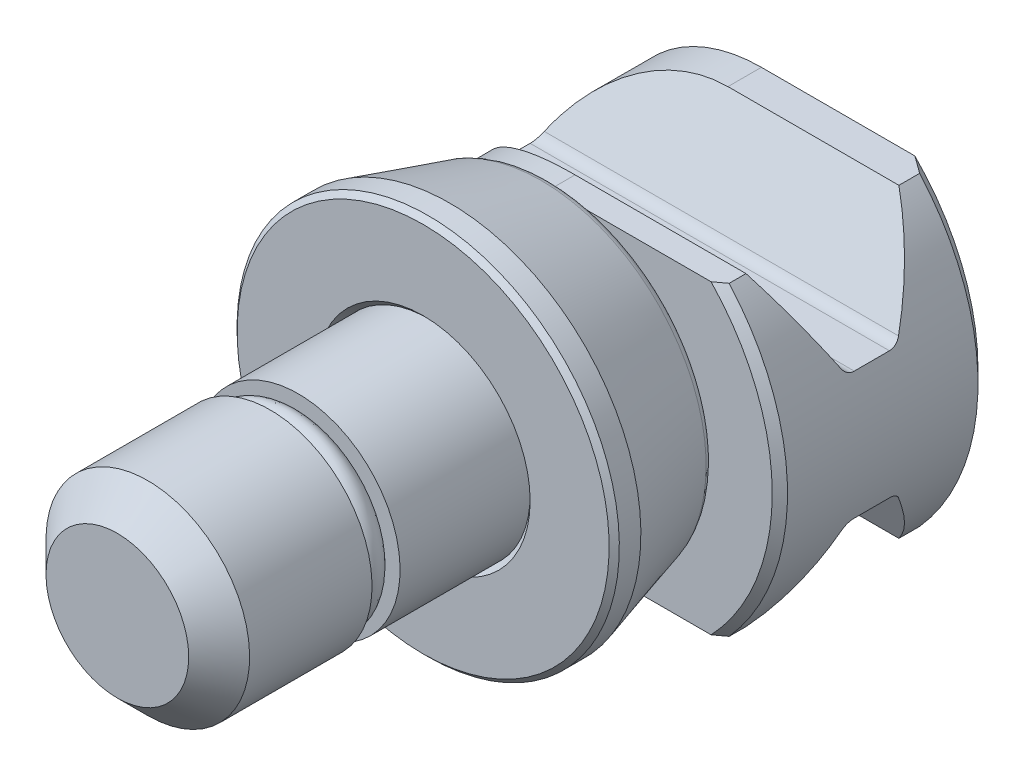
ISO-10303-21;
HEADER;
FILE_DESCRIPTION(('STEP AP214'),'2;1');
FILE_NAME('part.step','',(''),(''),'','','');
FILE_SCHEMA(('AUTOMOTIVE_DESIGN { 1 0 10303 214 1 1 1 1 }'));
ENDSEC;
DATA;
#1=APPLICATION_CONTEXT('core data for automotive mechanical design processes');
#2=APPLICATION_PROTOCOL_DEFINITION('international standard','automotive_design',2000,#1);
#3=PRODUCT_CONTEXT('',#1,'mechanical');
#4=PRODUCT('Part','Part','',(#3));
#5=PRODUCT_RELATED_PRODUCT_CATEGORY('part','',(#4));
#6=PRODUCT_DEFINITION_FORMATION('','',#4);
#7=PRODUCT_DEFINITION_CONTEXT('part definition',#1,'design');
#8=PRODUCT_DEFINITION('design','',#6,#7);
#9=PRODUCT_DEFINITION_SHAPE('','',#8);
#10=(LENGTH_UNIT() NAMED_UNIT(*) SI_UNIT(.MILLI.,.METRE.));
#11=(NAMED_UNIT(*) PLANE_ANGLE_UNIT() SI_UNIT($,.RADIAN.));
#12=(NAMED_UNIT(*) SI_UNIT($,.STERADIAN.) SOLID_ANGLE_UNIT());
#13=UNCERTAINTY_MEASURE_WITH_UNIT(LENGTH_MEASURE(1.E-05),#10,'distance_accuracy_value','');
#14=(GEOMETRIC_REPRESENTATION_CONTEXT(3) GLOBAL_UNCERTAINTY_ASSIGNED_CONTEXT((#13)) GLOBAL_UNIT_ASSIGNED_CONTEXT((#10,
#11,#12)) REPRESENTATION_CONTEXT('',''));
#15=CARTESIAN_POINT('',(0.,0.,0.));
#16=DIRECTION('',(0.,0.,1.));
#17=DIRECTION('',(1.,0.,0.));
#18=AXIS2_PLACEMENT_3D('',#15,#16,#17);
#19=CARTESIAN_POINT('',(0.,0.,-4.5));
#20=DIRECTION('',(0.,0.,-1.));
#21=DIRECTION('',(0.,1.,0.));
#22=AXIS2_PLACEMENT_3D('',#19,#20,#21);
#23=TOROIDAL_SURFACE('',#22,5.9894960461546,0.5);
#24=CARTESIAN_POINT('',(0.,0.,-5.));
#25=DIRECTION('',(0.,0.,-1.));
#26=DIRECTION('',(0.,1.,0.));
#27=AXIS2_PLACEMENT_3D('',#24,#25,#26);
#28=CIRCLE('',#27,5.9894960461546);
#29=CARTESIAN_POINT('',(0.,5.9894960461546,-5.));
#30=VERTEX_POINT('',#29);
#31=EDGE_CURVE('E10',#30,#30,#28,.T.);
#32=ORIENTED_EDGE('',*,*,#31,.F.);
#33=EDGE_LOOP('',(#32));
#34=FACE_BOUND('',#33,.T.);
#35=CARTESIAN_POINT('',(0.,0.,-4.6378186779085));
#36=DIRECTION('',(0.,0.,-1.));
#37=DIRECTION('',(0.,1.,0.));
#38=AXIS2_PLACEMENT_3D('',#35,#36,#37);
#39=CIRCLE('',#38,6.47012689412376);
#40=CARTESIAN_POINT('',(0.,6.47012689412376,-4.6378186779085));
#41=VERTEX_POINT('',#40);
#42=EDGE_CURVE('E999',#41,#41,#39,.F.);
#43=ORIENTED_EDGE('',*,*,#42,.F.);
#44=EDGE_LOOP('',(#43));
#45=FACE_BOUND('',#44,.T.);
#46=ADVANCED_FACE('F16',(#34,#45),#23,.T.);
#47=CARTESIAN_POINT('',(0.,0.,-1.0462243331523));
#48=DIRECTION('',(0.,0.,1.));
#49=DIRECTION('',(0.,-1.,0.));
#50=AXIS2_PLACEMENT_3D('',#47,#48,#49);
#51=CONICAL_SURFACE('',#50,7.5,0.279252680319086);
#52=ORIENTED_EDGE('',*,*,#42,.T.);
#53=EDGE_LOOP('',(#52));
#54=FACE_BOUND('',#53,.T.);
#55=CARTESIAN_POINT('',(0.,0.,-1.0462243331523));
#56=DIRECTION('',(0.,0.,1.));
#57=DIRECTION('',(0.,-1.,0.));
#58=AXIS2_PLACEMENT_3D('',#55,#56,#57);
#59=CIRCLE('',#58,7.5);
#60=CARTESIAN_POINT('',(0.,-7.5,-1.0462243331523));
#61=VERTEX_POINT('',#60);
#62=EDGE_CURVE('E1008',#61,#61,#59,.T.);
#63=ORIENTED_EDGE('',*,*,#62,.F.);
#64=EDGE_LOOP('',(#63));
#65=FACE_BOUND('',#64,.T.);
#66=ADVANCED_FACE('F515',(#54,#65),#51,.T.);
#67=CARTESIAN_POINT('',(0.,0.,0.));
#68=DIRECTION('',(0.,0.,-1.));
#69=DIRECTION('',(0.,1.,0.));
#70=AXIS2_PLACEMENT_3D('',#67,#68,#69);
#71=CYLINDRICAL_SURFACE('',#70,7.5);
#72=CARTESIAN_POINT('',(0.,0.,-0.2));
#73=DIRECTION('',(0.,0.,1.));
#74=DIRECTION('',(0.,-1.,0.));
#75=AXIS2_PLACEMENT_3D('',#72,#73,#74);
#76=CIRCLE('',#75,7.5);
#77=CARTESIAN_POINT('',(0.,-7.5,-0.2));
#78=VERTEX_POINT('',#77);
#79=EDGE_CURVE('E1006',#78,#78,#76,.F.);
#80=ORIENTED_EDGE('',*,*,#79,.T.);
#81=EDGE_LOOP('',(#80));
#82=FACE_BOUND('',#81,.T.);
#83=ORIENTED_EDGE('',*,*,#62,.T.);
#84=EDGE_LOOP('',(#83));
#85=FACE_BOUND('',#84,.T.);
#86=ADVANCED_FACE('F518',(#82,#85),#71,.T.);
#87=CARTESIAN_POINT('',(0.,0.,0.));
#88=DIRECTION('',(0.,0.,-1.));
#89=DIRECTION('',(0.,1.,0.));
#90=AXIS2_PLACEMENT_3D('',#87,#88,#89);
#91=CYLINDRICAL_SURFACE('',#90,4.);
#92=CARTESIAN_POINT('',(0.,0.,-0.200000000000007));
#93=DIRECTION('',(0.,0.,1.));
#94=DIRECTION('',(0.,-1.,0.));
#95=AXIS2_PLACEMENT_3D('',#92,#93,#94);
#96=CIRCLE('',#95,4.);
#97=CARTESIAN_POINT('',(0.,-4.,-0.200000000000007));
#98=VERTEX_POINT('',#97);
#99=EDGE_CURVE('E20',#98,#98,#96,.T.);
#100=ORIENTED_EDGE('',*,*,#99,.T.);
#101=EDGE_LOOP('',(#100));
#102=FACE_BOUND('',#101,.T.);
#103=CARTESIAN_POINT('',(0.,0.,-1.));
#104=DIRECTION('',(0.,0.,-1.));
#105=DIRECTION('',(0.,-1.,0.));
#106=AXIS2_PLACEMENT_3D('',#103,#104,#105);
#107=CIRCLE('',#106,4.);
#108=CARTESIAN_POINT('',(0.,-4.,-1.));
#109=VERTEX_POINT('',#108);
#110=EDGE_CURVE('E253',#109,#109,#107,.F.);
#111=ORIENTED_EDGE('',*,*,#110,.F.);
#112=EDGE_LOOP('',(#111));
#113=FACE_BOUND('',#112,.T.);
#114=ADVANCED_FACE('F527',(#102,#113),#91,.F.);
#115=CARTESIAN_POINT('',(0.,0.,0.));
#116=DIRECTION('',(0.,0.,1.));
#117=DIRECTION('',(0.,-1.,0.));
#118=AXIS2_PLACEMENT_3D('',#115,#116,#117);
#119=CONICAL_SURFACE('',#118,4.2,0.785398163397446);
#120=ORIENTED_EDGE('',*,*,#99,.F.);
#121=EDGE_LOOP('',(#120));
#122=FACE_BOUND('',#121,.T.);
#123=CARTESIAN_POINT('',(0.,0.,0.));
#124=DIRECTION('',(0.,0.,1.));
#125=DIRECTION('',(0.,-1.,0.));
#126=AXIS2_PLACEMENT_3D('',#123,#124,#125);
#127=CIRCLE('',#126,4.2);
#128=CARTESIAN_POINT('',(0.,-4.2,0.));
#129=VERTEX_POINT('',#128);
#130=EDGE_CURVE('E998',#129,#129,#127,.F.);
#131=ORIENTED_EDGE('',*,*,#130,.F.);
#132=EDGE_LOOP('',(#131));
#133=FACE_BOUND('',#132,.T.);
#134=ADVANCED_FACE('F18',(#122,#133),#119,.F.);
#135=CARTESIAN_POINT('',(4.,0.,0.));
#136=DIRECTION('',(0.,0.,1.));
#137=DIRECTION('',(0.,-1.,0.));
#138=AXIS2_PLACEMENT_3D('',#135,#136,#137);
#139=PLANE('',#138);
#140=ORIENTED_EDGE('',*,*,#130,.T.);
#141=EDGE_LOOP('',(#140));
#142=FACE_BOUND('',#141,.T.);
#143=CARTESIAN_POINT('',(0.,0.,0.));
#144=DIRECTION('',(0.,0.,1.));
#145=DIRECTION('',(0.,-1.,0.));
#146=AXIS2_PLACEMENT_3D('',#143,#144,#145);
#147=CIRCLE('',#146,7.3);
#148=CARTESIAN_POINT('',(0.,-7.3,0.));
#149=VERTEX_POINT('',#148);
#150=EDGE_CURVE('E1001',#149,#149,#147,.T.);
#151=ORIENTED_EDGE('',*,*,#150,.T.);
#152=EDGE_LOOP('',(#151));
#153=FACE_BOUND('',#152,.T.);
#154=ADVANCED_FACE('F521',(#142,#153),#139,.T.);
#155=CARTESIAN_POINT('',(0.,0.,-0.2));
#156=DIRECTION('',(0.,0.,-1.));
#157=DIRECTION('',(0.,1.,0.));
#158=AXIS2_PLACEMENT_3D('',#155,#156,#157);
#159=CONICAL_SURFACE('',#158,7.5,0.785398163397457);
#160=ORIENTED_EDGE('',*,*,#150,.F.);
#161=EDGE_LOOP('',(#160));
#162=FACE_BOUND('',#161,.T.);
#163=ORIENTED_EDGE('',*,*,#79,.F.);
#164=EDGE_LOOP('',(#163));
#165=FACE_BOUND('',#164,.T.);
#166=ADVANCED_FACE('F520',(#162,#165),#159,.T.);
#167=CARTESIAN_POINT('',(0.,0.,-5.));
#168=DIRECTION('',(0.,0.,1.));
#169=DIRECTION('',(0.,1.,0.));
#170=AXIS2_PLACEMENT_3D('',#167,#168,#169);
#171=PLANE('',#170);
#172=ORIENTED_EDGE('',*,*,#31,.T.);
#173=EDGE_LOOP('',(#172));
#174=FACE_BOUND('',#173,.T.);
#175=DIRECTION('',(-1.,0.,0.));
#176=VECTOR('',#175,1.);
#177=CARTESIAN_POINT('',(0.,-6.,-5.));
#178=LINE('',#177,#176);
#179=CARTESIAN_POINT('',(6.3,-6.,-5.));
#180=VERTEX_POINT('',#179);
#181=CARTESIAN_POINT('',(0.,-6.,-5.));
#182=VERTEX_POINT('',#181);
#183=EDGE_CURVE('E300',#180,#182,#178,.T.);
#184=ORIENTED_EDGE('',*,*,#183,.F.);
#185=CARTESIAN_POINT('',(0.,0.,-5.));
#186=DIRECTION('',(0.,0.,1.));
#187=DIRECTION('',(0.,1.,0.));
#188=AXIS2_PLACEMENT_3D('',#185,#186,#187);
#189=CIRCLE('',#188,8.7);
#190=CARTESIAN_POINT('',(6.3,6.,-5.));
#191=VERTEX_POINT('',#190);
#192=EDGE_CURVE('E464',#180,#191,#189,.T.);
#193=ORIENTED_EDGE('',*,*,#192,.T.);
#194=DIRECTION('',(1.,0.,0.));
#195=VECTOR('',#194,1.);
#196=CARTESIAN_POINT('',(0.,6.,-5.));
#197=LINE('',#196,#195);
#198=CARTESIAN_POINT('',(0.,6.,-5.));
#199=VERTEX_POINT('',#198);
#200=EDGE_CURVE('E302',#199,#191,#197,.T.);
#201=ORIENTED_EDGE('',*,*,#200,.F.);
#202=CARTESIAN_POINT('',(0.,0.,-5.));
#203=DIRECTION('',(0.,0.,-1.));
#204=DIRECTION('',(0.,1.,0.));
#205=AXIS2_PLACEMENT_3D('',#202,#203,#204);
#206=CIRCLE('',#205,6.);
#207=EDGE_CURVE('E281',#182,#199,#206,.T.);
#208=ORIENTED_EDGE('',*,*,#207,.F.);
#209=EDGE_LOOP('',(#184,#193,#201,#208));
#210=FACE_BOUND('',#209,.T.);
#211=ADVANCED_FACE('F407',(#174,#210),#171,.T.);
#212=CARTESIAN_POINT('',(10.,-6.,-25.5));
#213=DIRECTION('',(0.,1.,0.));
#214=DIRECTION('',(-1.,0.,0.));
#215=AXIS2_PLACEMENT_3D('',#212,#213,#214);
#216=PLANE('',#215);
#217=DIRECTION('',(0.,0.,-1.));
#218=VECTOR('',#217,1.);
#219=CARTESIAN_POINT('',(6.70820393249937,-6.,-5.));
#220=LINE('',#219,#218);
#221=CARTESIAN_POINT('',(6.70820393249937,-6.,-5.96271324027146));
#222=VERTEX_POINT('',#221);
#223=CARTESIAN_POINT('',(6.70820393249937,-6.,-5.3));
#224=VERTEX_POINT('',#223);
#225=EDGE_CURVE('E293',#222,#224,#220,.F.);
#226=ORIENTED_EDGE('',*,*,#225,.T.);
#227=CARTESIAN_POINT('',(6.70820393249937,-6.,-5.3));
#228=CARTESIAN_POINT('',(6.6405142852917,-6.,-5.24953149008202));
#229=CARTESIAN_POINT('',(6.57265247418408,-6.,-5.19929724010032));
#230=CARTESIAN_POINT('',(6.4365844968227,-6.,-5.099297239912));
#231=CARTESIAN_POINT('',(6.36837833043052,-6.,-5.04953148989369));
#232=CARTESIAN_POINT('',(6.3,-6.,-5.));
#233=B_SPLINE_CURVE_WITH_KNOTS('',3,(#227,#228,#229,#230,#231,#232),.UNSPECIFIED.,.F.,.F.,(4,2,
4),(0.,0.253294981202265,0.50659006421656),.UNSPECIFIED.);
#234=EDGE_CURVE('E450',#224,#180,#233,.T.);
#235=ORIENTED_EDGE('',*,*,#234,.T.);
#236=ORIENTED_EDGE('',*,*,#183,.T.);
#237=DIRECTION('',(0.,0.,1.));
#238=VECTOR('',#237,1.);
#239=CARTESIAN_POINT('',(0.,-6.,-25.2));
#240=LINE('',#239,#238);
#241=CARTESIAN_POINT('',(0.,-6.,-5.96271324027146));
#242=VERTEX_POINT('',#241);
#243=EDGE_CURVE('E284',#242,#182,#240,.T.);
#244=ORIENTED_EDGE('',*,*,#243,.F.);
#245=DIRECTION('',(1.,0.,0.));
#246=VECTOR('',#245,1.);
#247=CARTESIAN_POINT('',(10.,-6.,-5.96271324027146));
#248=LINE('',#247,#246);
#249=EDGE_CURVE('E310',#242,#222,#248,.T.);
#250=ORIENTED_EDGE('',*,*,#249,.T.);
#251=EDGE_LOOP('',(#226,#235,#236,#244,#250));
#252=FACE_BOUND('',#251,.T.);
#253=ADVANCED_FACE('F444',(#252),#216,.F.);
#254=CARTESIAN_POINT('',(0.,0.,-5.3));
#255=DIRECTION('',(0.,0.,-1.));
#256=DIRECTION('',(0.,-1.,0.));
#257=AXIS2_PLACEMENT_3D('',#254,#255,#256);
#258=CONICAL_SURFACE('',#257,9.,0.785398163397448);
#259=CARTESIAN_POINT('',(6.3,6.,-5.));
#260=CARTESIAN_POINT('',(6.36837833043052,6.,-5.0495314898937));
#261=CARTESIAN_POINT('',(6.4365844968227,6.00000000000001,-5.099297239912));
#262=CARTESIAN_POINT('',(6.57265247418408,6.00000000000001,-5.19929724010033));
#263=CARTESIAN_POINT('',(6.64051428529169,6.,-5.24953149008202));
#264=CARTESIAN_POINT('',(6.70820393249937,6.,-5.3));
#265=B_SPLINE_CURVE_WITH_KNOTS('',3,(#259,#260,#261,#262,#263,#264),.UNSPECIFIED.,.F.,.F.,(4,2,
4),(0.,0.253295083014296,0.50659006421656),.UNSPECIFIED.);
#266=CARTESIAN_POINT('',(6.70820393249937,6.,-5.3));
#267=VERTEX_POINT('',#266);
#268=EDGE_CURVE('E457',#191,#267,#265,.T.);
#269=ORIENTED_EDGE('',*,*,#268,.F.);
#270=ORIENTED_EDGE('',*,*,#192,.F.);
#271=ORIENTED_EDGE('',*,*,#234,.F.);
#272=CARTESIAN_POINT('',(0.,0.,-5.3));
#273=DIRECTION('',(0.,0.,1.));
#274=DIRECTION('',(0.,1.,0.));
#275=AXIS2_PLACEMENT_3D('',#272,#273,#274);
#276=CIRCLE('',#275,9.);
#277=EDGE_CURVE('E925',#267,#224,#276,.F.);
#278=ORIENTED_EDGE('',*,*,#277,.F.);
#279=EDGE_LOOP('',(#269,#270,#271,#278));
#280=FACE_BOUND('',#279,.T.);
#281=ADVANCED_FACE('F438',(#280),#258,.T.);
#282=CARTESIAN_POINT('',(10.,6.,-25.5));
#283=DIRECTION('',(0.,-1.,0.));
#284=DIRECTION('',(0.,0.,1.));
#285=AXIS2_PLACEMENT_3D('',#282,#283,#284);
#286=PLANE('',#285);
#287=ORIENTED_EDGE('',*,*,#200,.T.);
#288=ORIENTED_EDGE('',*,*,#268,.T.);
#289=DIRECTION('',(0.,0.,-1.));
#290=VECTOR('',#289,1.);
#291=CARTESIAN_POINT('',(6.70820393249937,6.,-5.));
#292=LINE('',#291,#290);
#293=CARTESIAN_POINT('',(6.70820393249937,6.,-5.96271324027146));
#294=VERTEX_POINT('',#293);
#295=EDGE_CURVE('E291',#267,#294,#292,.T.);
#296=ORIENTED_EDGE('',*,*,#295,.T.);
#297=DIRECTION('',(-1.,0.,0.));
#298=VECTOR('',#297,1.);
#299=CARTESIAN_POINT('',(15.,6.,-5.96271324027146));
#300=LINE('',#299,#298);
#301=CARTESIAN_POINT('',(0.,6.,-5.96271324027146));
#302=VERTEX_POINT('',#301);
#303=EDGE_CURVE('E255',#294,#302,#300,.T.);
#304=ORIENTED_EDGE('',*,*,#303,.T.);
#305=DIRECTION('',(0.,0.,1.));
#306=VECTOR('',#305,1.);
#307=CARTESIAN_POINT('',(0.,6.,-25.2));
#308=LINE('',#307,#306);
#309=EDGE_CURVE('E285',#302,#199,#308,.T.);
#310=ORIENTED_EDGE('',*,*,#309,.T.);
#311=EDGE_LOOP('',(#287,#288,#296,#304,#310));
#312=FACE_BOUND('',#311,.T.);
#313=ADVANCED_FACE('F443',(#312),#286,.F.);
#314=CARTESIAN_POINT('',(0.,0.,-25.2));
#315=DIRECTION('',(0.,0.,1.));
#316=DIRECTION('',(0.,1.,0.));
#317=AXIS2_PLACEMENT_3D('',#314,#315,#316);
#318=CYLINDRICAL_SURFACE('',#317,6.);
#319=CARTESIAN_POINT('',(0.,0.,-8.49861162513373));
#320=DIRECTION('',(0.,0.5,0.86602540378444));
#321=DIRECTION('',(0.,-0.866025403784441,0.5));
#322=AXIS2_PLACEMENT_3D('',#319,#320,#321);
#323=ELLIPSE('',#322,6.9282032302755,6.);
#324=CARTESIAN_POINT('',(0.,6.,-11.9627132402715));
#325=VERTEX_POINT('',#324);
#326=CARTESIAN_POINT('',(-5.33268225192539,2.75,-10.0863248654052));
#327=VERTEX_POINT('',#326);
#328=EDGE_CURVE('E262',#325,#327,#323,.T.);
#329=ORIENTED_EDGE('',*,*,#328,.F.);
#330=CARTESIAN_POINT('',(0.,6.,-13.275));
#331=VERTEX_POINT('',#330);
#332=EDGE_CURVE('E287',#331,#325,#308,.T.);
#333=ORIENTED_EDGE('',*,*,#332,.F.);
#334=CARTESIAN_POINT('',(0.,0.,-13.275));
#335=DIRECTION('',(0.,0.,1.));
#336=DIRECTION('',(0.,1.,0.));
#337=AXIS2_PLACEMENT_3D('',#334,#335,#336);
#338=CIRCLE('',#337,6.);
#339=CARTESIAN_POINT('',(0.,-6.,-13.275));
#340=VERTEX_POINT('',#339);
#341=EDGE_CURVE('E305',#331,#340,#338,.T.);
#342=ORIENTED_EDGE('',*,*,#341,.T.);
#343=CARTESIAN_POINT('',(0.,-6.,-11.9627132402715));
#344=VERTEX_POINT('',#343);
#345=EDGE_CURVE('E288',#340,#344,#240,.T.);
#346=ORIENTED_EDGE('',*,*,#345,.T.);
#347=CARTESIAN_POINT('',(0.,0.,-8.49861162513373));
#348=DIRECTION('',(0.,0.5,-0.86602540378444));
#349=DIRECTION('',(0.,0.866025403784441,0.5));
#350=AXIS2_PLACEMENT_3D('',#347,#348,#349);
#351=ELLIPSE('',#350,6.9282032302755,6.);
#352=CARTESIAN_POINT('',(-5.33268225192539,-2.75,-10.0863248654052));
#353=VERTEX_POINT('',#352);
#354=EDGE_CURVE('E271',#344,#353,#351,.T.);
#355=ORIENTED_EDGE('',*,*,#354,.T.);
#356=CARTESIAN_POINT('',(-5.33268225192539,-2.75,-10.0863248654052));
#357=CARTESIAN_POINT('',(-5.34475324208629,-2.7266029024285,-10.0728451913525));
#358=CARTESIAN_POINT('',(-5.35618869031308,-2.70403892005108,-10.0572626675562));
#359=CARTESIAN_POINT('',(-5.37755487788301,-2.66128948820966,-10.022143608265));
#360=CARTESIAN_POINT('',(-5.38748089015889,-2.64111155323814,-10.002595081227));
#361=CARTESIAN_POINT('',(-5.40554463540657,-2.60394326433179,-9.95981715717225));
#362=CARTESIAN_POINT('',(-5.4136768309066,-2.58696280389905,-9.93657673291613));
#363=CARTESIAN_POINT('',(-5.42786315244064,-2.55706390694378,-9.88706764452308));
#364=CARTESIAN_POINT('',(-5.43391962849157,-2.544140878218,-9.8608024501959));
#365=CARTESIAN_POINT('',(-5.443411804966,-2.52376416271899,-9.80804187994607));
#366=CARTESIAN_POINT('',(-5.44700580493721,-2.51598161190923,-9.78170154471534));
#367=CARTESIAN_POINT('',(-5.45213658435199,-2.504844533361,-9.72794637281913));
#368=CARTESIAN_POINT('',(-5.45367835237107,-2.50147926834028,-9.70053430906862));
#369=CARTESIAN_POINT('',(-5.45429677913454,-2.50012911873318,-9.66647580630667));
#370=CARTESIAN_POINT('',(-5.45435646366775,-2.49999877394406,-9.65989246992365));
#371=CARTESIAN_POINT('',(-5.45435605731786,-2.5,-9.65331216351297));
#372=B_SPLINE_CURVE_WITH_KNOTS('',3,(#356,#357,#358,#359,#360,#361,#362,#363,#364,#365,#366,
#367,#368,#369,#370,#371),.UNSPECIFIED.,.F.,.F.,(4,2,2,2,2,2,2,4),(0.,0.0887050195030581,
0.17768235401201,0.266930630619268,0.35607752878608,0.438754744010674,0.521230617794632,
0.540978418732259),.UNSPECIFIED.);
#373=CARTESIAN_POINT('',(-5.45435605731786,-2.5,-9.65331216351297));
#374=VERTEX_POINT('',#373);
#375=EDGE_CURVE('E345',#353,#374,#372,.T.);
#376=ORIENTED_EDGE('',*,*,#375,.T.);
#377=DIRECTION('',(0.,0.,1.));
#378=VECTOR('',#377,1.);
#379=CARTESIAN_POINT('',(-5.45435605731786,-2.5,-25.2));
#380=LINE('',#379,#378);
#381=CARTESIAN_POINT('',(-5.45435605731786,-2.5,-8.27211431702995));
#382=VERTEX_POINT('',#381);
#383=EDGE_CURVE('E278',#374,#382,#380,.T.);
#384=ORIENTED_EDGE('',*,*,#383,.T.);
#385=CARTESIAN_POINT('',(-5.45435605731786,-2.5,-8.27211431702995));
#386=CARTESIAN_POINT('',(-5.45436490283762,-2.4999688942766,-8.2459340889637));
#387=CARTESIAN_POINT('',(-5.45341453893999,-2.50205408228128,-8.21977283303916));
#388=CARTESIAN_POINT('',(-5.44966589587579,-2.51021455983,-8.16829299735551));
#389=CARTESIAN_POINT('',(-5.44687308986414,-2.5162780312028,-8.14297215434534));
#390=CARTESIAN_POINT('',(-5.43951038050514,-2.53215290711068,-8.09382141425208));
#391=CARTESIAN_POINT('',(-5.43494098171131,-2.54196324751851,-8.0699910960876));
#392=CARTESIAN_POINT('',(-5.4241421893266,-2.56492550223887,-8.02440168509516));
#393=CARTESIAN_POINT('',(-5.41791194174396,-2.57807913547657,-8.00264366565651));
#394=CARTESIAN_POINT('',(-5.4037204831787,-2.60769678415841,-7.96103367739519));
#395=CARTESIAN_POINT('',(-5.39571089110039,-2.6242520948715,-7.94126343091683));
#396=CARTESIAN_POINT('',(-5.37827561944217,-2.65980076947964,-7.9048107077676));
#397=CARTESIAN_POINT('',(-5.36885043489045,-2.67879328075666,-7.88812715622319));
#398=CARTESIAN_POINT('',(-5.35050377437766,-2.71522718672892,-7.86061048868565));
#399=CARTESIAN_POINT('',(-5.34177183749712,-2.73237833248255,-7.84926478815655));
#400=CARTESIAN_POINT('',(-5.33268225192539,-2.75,-7.83910161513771));
#401=B_SPLINE_CURVE_WITH_KNOTS('',3,(#385,#386,#387,#388,#389,#390,#391,#392,#393,#394,#395,
#396,#397,#398,#399,#400),.UNSPECIFIED.,.F.,.F.,(4,2,2,2,2,2,2,4),(0.,0.0784111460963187,
0.156590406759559,0.234747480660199,0.312944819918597,0.393607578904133,0.474242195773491,
0.54108617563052),.UNSPECIFIED.);
#402=CARTESIAN_POINT('',(-5.33268225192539,-2.75,-7.83910161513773));
#403=VERTEX_POINT('',#402);
#404=EDGE_CURVE('E384',#382,#403,#401,.T.);
#405=ORIENTED_EDGE('',*,*,#404,.T.);
#406=CARTESIAN_POINT('',(0.,0.,-9.42681485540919));
#407=DIRECTION('',(0.,0.5,0.86602540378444));
#408=DIRECTION('',(0.,-0.866025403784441,0.5));
#409=AXIS2_PLACEMENT_3D('',#406,#407,#408);
#410=ELLIPSE('',#409,6.9282032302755,6.);
#411=EDGE_CURVE('E276',#403,#242,#410,.T.);
#412=ORIENTED_EDGE('',*,*,#411,.T.);
#413=ORIENTED_EDGE('',*,*,#243,.T.);
#414=ORIENTED_EDGE('',*,*,#207,.T.);
#415=ORIENTED_EDGE('',*,*,#309,.F.);
#416=CARTESIAN_POINT('',(0.,0.,-9.42681485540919));
#417=DIRECTION('',(0.,0.5,-0.86602540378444));
#418=DIRECTION('',(0.,0.866025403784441,0.5));
#419=AXIS2_PLACEMENT_3D('',#416,#417,#418);
#420=ELLIPSE('',#419,6.9282032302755,6.);
#421=CARTESIAN_POINT('',(-5.33268225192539,2.75,-7.83910161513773));
#422=VERTEX_POINT('',#421);
#423=EDGE_CURVE('E258',#422,#302,#420,.T.);
#424=ORIENTED_EDGE('',*,*,#423,.F.);
#425=CARTESIAN_POINT('',(-5.33268225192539,2.75,-7.83910161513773));
#426=CARTESIAN_POINT('',(-5.34475324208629,2.72660290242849,-7.8525812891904));
#427=CARTESIAN_POINT('',(-5.35618869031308,2.70403892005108,-7.86816381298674));
#428=CARTESIAN_POINT('',(-5.37755487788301,2.66128948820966,-7.90328287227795));
#429=CARTESIAN_POINT('',(-5.38748089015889,2.64111155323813,-7.92283139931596));
#430=CARTESIAN_POINT('',(-5.40554463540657,2.60394326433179,-7.96560932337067));
#431=CARTESIAN_POINT('',(-5.4136768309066,2.58696280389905,-7.98884974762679));
#432=CARTESIAN_POINT('',(-5.42786315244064,2.55706390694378,-8.03835883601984));
#433=CARTESIAN_POINT('',(-5.43391962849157,2.544140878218,-8.06462403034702));
#434=CARTESIAN_POINT('',(-5.443411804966,2.52376416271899,-8.11738460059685));
#435=CARTESIAN_POINT('',(-5.44700580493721,2.51598161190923,-8.14372493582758));
#436=CARTESIAN_POINT('',(-5.45213658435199,2.504844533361,-8.19748010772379));
#437=CARTESIAN_POINT('',(-5.45367835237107,2.50147926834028,-8.22489217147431));
#438=CARTESIAN_POINT('',(-5.45429677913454,2.50012911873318,-8.25895067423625));
#439=CARTESIAN_POINT('',(-5.45435646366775,2.49999877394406,-8.26553401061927));
#440=CARTESIAN_POINT('',(-5.45435605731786,2.5,-8.27211431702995));
#441=B_SPLINE_CURVE_WITH_KNOTS('',3,(#425,#426,#427,#428,#429,#430,#431,#432,#433,#434,#435,
#436,#437,#438,#439,#440),.UNSPECIFIED.,.F.,.F.,(4,2,2,2,2,2,2,4),(0.,0.0887050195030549,
0.177682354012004,0.266930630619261,0.356077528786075,0.438754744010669,0.521230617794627,
0.540978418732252),.UNSPECIFIED.);
#442=CARTESIAN_POINT('',(-5.45435605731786,2.5,-8.27211431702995));
#443=VERTEX_POINT('',#442);
#444=EDGE_CURVE('E396',#422,#443,#441,.T.);
#445=ORIENTED_EDGE('',*,*,#444,.T.);
#446=DIRECTION('',(0.,0.,1.));
#447=VECTOR('',#446,1.);
#448=CARTESIAN_POINT('',(-5.45435605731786,2.5,-25.2));
#449=LINE('',#448,#447);
#450=CARTESIAN_POINT('',(-5.45435605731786,2.5,-9.65331216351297));
#451=VERTEX_POINT('',#450);
#452=EDGE_CURVE('E265',#451,#443,#449,.T.);
#453=ORIENTED_EDGE('',*,*,#452,.F.);
#454=CARTESIAN_POINT('',(-5.45435605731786,2.5,-9.65331216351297));
#455=CARTESIAN_POINT('',(-5.45436490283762,2.4999688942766,-9.67949239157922));
#456=CARTESIAN_POINT('',(-5.45341453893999,2.50205408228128,-9.70565364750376));
#457=CARTESIAN_POINT('',(-5.44966589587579,2.51021455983,-9.7571334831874));
#458=CARTESIAN_POINT('',(-5.44687308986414,2.5162780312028,-9.78245432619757));
#459=CARTESIAN_POINT('',(-5.43951038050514,2.53215290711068,-9.83160506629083));
#460=CARTESIAN_POINT('',(-5.43494098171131,2.54196324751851,-9.85543538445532));
#461=CARTESIAN_POINT('',(-5.4241421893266,2.56492550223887,-9.90102479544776));
#462=CARTESIAN_POINT('',(-5.41791194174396,2.57807913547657,-9.92278281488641));
#463=CARTESIAN_POINT('',(-5.4037204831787,2.60769678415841,-9.96439280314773));
#464=CARTESIAN_POINT('',(-5.39571089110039,2.6242520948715,-9.98416304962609));
#465=CARTESIAN_POINT('',(-5.37827561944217,2.65980076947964,-10.0206157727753));
#466=CARTESIAN_POINT('',(-5.36885043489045,2.67879328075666,-10.0372993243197));
#467=CARTESIAN_POINT('',(-5.35050377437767,2.71522718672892,-10.0648159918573));
#468=CARTESIAN_POINT('',(-5.34177183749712,2.73237833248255,-10.0761616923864));
#469=CARTESIAN_POINT('',(-5.33268225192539,2.75,-10.0863248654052));
#470=B_SPLINE_CURVE_WITH_KNOTS('',3,(#454,#455,#456,#457,#458,#459,#460,#461,#462,#463,#464,
#465,#466,#467,#468,#469),.UNSPECIFIED.,.F.,.F.,(4,2,2,2,2,2,2,4),(0.,0.0784111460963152,
0.15659040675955,0.234747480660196,0.312944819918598,0.393607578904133,0.474242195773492,
0.541086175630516),.UNSPECIFIED.);
#471=EDGE_CURVE('E420',#451,#327,#470,.T.);
#472=ORIENTED_EDGE('',*,*,#471,.T.);
#473=EDGE_LOOP('',(#329,#333,#342,#346,#355,#376,#384,#405,#412,#413,#414,#415,#424,#445,#453,#472));
#474=FACE_BOUND('',#473,.T.);
#475=ADVANCED_FACE('F360',(#474),#318,.T.);
#476=CARTESIAN_POINT('',(0.,0.,-5.));
#477=DIRECTION('',(0.,0.,-1.));
#478=DIRECTION('',(0.,-1.,0.));
#479=AXIS2_PLACEMENT_3D('',#476,#477,#478);
#480=CYLINDRICAL_SURFACE('',#479,9.);
#481=CARTESIAN_POINT('',(6.70820393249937,-6.,-12.775));
#482=VERTEX_POINT('',#481);
#483=CARTESIAN_POINT('',(6.70820393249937,-6.,-11.9627132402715));
#484=VERTEX_POINT('',#483);
#485=EDGE_CURVE('E295',#482,#484,#220,.F.);
#486=ORIENTED_EDGE('',*,*,#485,.F.);
#487=CARTESIAN_POINT('',(0.,0.,-12.775));
#488=DIRECTION('',(0.,0.,1.));
#489=DIRECTION('',(0.,1.,0.));
#490=AXIS2_PLACEMENT_3D('',#487,#488,#489);
#491=CIRCLE('',#490,9.);
#492=CARTESIAN_POINT('',(6.70820393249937,6.,-12.775));
#493=VERTEX_POINT('',#492);
#494=EDGE_CURVE('E41',#482,#493,#491,.T.);
#495=ORIENTED_EDGE('',*,*,#494,.T.);
#496=CARTESIAN_POINT('',(6.70820393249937,6.,-11.9627132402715));
#497=VERTEX_POINT('',#496);
#498=EDGE_CURVE('E294',#497,#493,#292,.T.);
#499=ORIENTED_EDGE('',*,*,#498,.F.);
#500=CARTESIAN_POINT('',(0.,0.,-8.49861162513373));
#501=DIRECTION('',(0.,0.5,0.86602540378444));
#502=DIRECTION('',(0.,0.866025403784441,-0.5));
#503=AXIS2_PLACEMENT_3D('',#500,#501,#502);
#504=ELLIPSE('',#503,10.3923048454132,9.);
#505=CARTESIAN_POINT('',(8.56956825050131,2.75,-10.0863248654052));
#506=VERTEX_POINT('',#505);
#507=EDGE_CURVE('E322',#497,#506,#504,.F.);
#508=ORIENTED_EDGE('',*,*,#507,.T.);
#509=CARTESIAN_POINT('',(8.56956825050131,2.75,-10.0863248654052));
#510=CARTESIAN_POINT('',(8.57724769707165,2.72607635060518,-10.072541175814));
#511=CARTESIAN_POINT('',(8.58447567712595,2.70320069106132,-10.0566648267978));
#512=CARTESIAN_POINT('',(8.59789140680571,2.66021812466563,-10.0211691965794));
#513=CARTESIAN_POINT('',(8.60407914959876,2.64011123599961,-10.0015498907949));
#514=CARTESIAN_POINT('',(8.61528842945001,2.60330179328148,-9.95896751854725));
#515=CARTESIAN_POINT('',(8.62030756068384,2.58660627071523,-9.93599770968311));
#516=CARTESIAN_POINT('',(8.62905411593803,2.55727570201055,-9.88740696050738));
#517=CARTESIAN_POINT('',(8.63278261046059,2.54463729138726,-9.86178824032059));
#518=CARTESIAN_POINT('',(8.63912061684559,2.52304068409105,-9.80647191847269));
#519=CARTESIAN_POINT('',(8.64161686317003,2.51445740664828,-9.7766119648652));
#520=CARTESIAN_POINT('',(8.6441257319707,2.50581290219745,-9.73091866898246));
#521=CARTESIAN_POINT('',(8.64475612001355,2.50363636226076,-9.71548867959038));
#522=CARTESIAN_POINT('',(8.64559725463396,2.50072974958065,-9.68447995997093));
#523=CARTESIAN_POINT('',(8.64580795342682,2.49999984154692,-9.6689012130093));
#524=CARTESIAN_POINT('',(8.64580823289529,2.5,-9.65331216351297));
#525=B_SPLINE_CURVE_WITH_KNOTS('',3,(#509,#510,#511,#512,#513,#514,#515,#516,#517,#518,#519,
#520,#521,#522,#523,#524),.UNSPECIFIED.,.F.,.F.,(4,2,2,2,2,2,2,4),(0.,0.0858971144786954,
0.171794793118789,0.25786777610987,0.343869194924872,0.436744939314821,0.483467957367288,
0.530196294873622),.UNSPECIFIED.);
#526=CARTESIAN_POINT('',(8.64580823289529,2.5,-9.65331216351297));
#527=VERTEX_POINT('',#526);
#528=EDGE_CURVE('E425',#506,#527,#525,.T.);
#529=ORIENTED_EDGE('',*,*,#528,.T.);
#530=DIRECTION('',(0.,0.,-1.));
#531=VECTOR('',#530,1.);
#532=CARTESIAN_POINT('',(8.64580823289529,2.5,-5.));
#533=LINE('',#532,#531);
#534=CARTESIAN_POINT('',(8.64580823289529,2.5,-8.27211431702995));
#535=VERTEX_POINT('',#534);
#536=EDGE_CURVE('E319',#527,#535,#533,.F.);
#537=ORIENTED_EDGE('',*,*,#536,.T.);
#538=CARTESIAN_POINT('',(8.64580823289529,2.5,-8.27211431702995));
#539=CARTESIAN_POINT('',(8.6458125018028,2.49997249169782,-8.24483001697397));
#540=CARTESIAN_POINT('',(8.64516293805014,2.50223148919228,-8.21755808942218));
#541=CARTESIAN_POINT('',(8.64258935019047,2.51111277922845,-8.16385009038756));
#542=CARTESIAN_POINT('',(8.64066786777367,2.51772636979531,-8.13741246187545));
#543=CARTESIAN_POINT('',(8.63558319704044,2.53510938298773,-8.086067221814));
#544=CARTESIAN_POINT('',(8.63241990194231,2.5458791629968,-8.06115974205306));
#545=CARTESIAN_POINT('',(8.62491001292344,2.5712063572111,-8.01353505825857));
#546=CARTESIAN_POINT('',(8.62056284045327,2.58576562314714,-7.99081893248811));
#547=CARTESIAN_POINT('',(8.61069465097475,2.6184408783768,-7.94784146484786));
#548=CARTESIAN_POINT('',(8.60515689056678,2.63660728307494,-7.92762239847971));
#549=CARTESIAN_POINT('',(8.59306244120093,2.67576053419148,-7.89054701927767));
#550=CARTESIAN_POINT('',(8.586507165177,2.69674346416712,-7.87368611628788));
#551=CARTESIAN_POINT('',(8.57628879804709,2.72899008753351,-7.85174962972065));
#552=CARTESIAN_POINT('',(8.57297160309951,2.73939542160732,-7.84522072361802));
#553=CARTESIAN_POINT('',(8.56956825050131,2.75,-7.83910161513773));
#554=B_SPLINE_CURVE_WITH_KNOTS('',3,(#538,#539,#540,#541,#542,#543,#544,#545,#546,#547,#548,
#549,#550,#551,#552,#553),.UNSPECIFIED.,.F.,.F.,(4,2,2,2,2,2,2,4),(0.,0.0817331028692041,
0.163303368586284,0.244880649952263,0.326497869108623,0.409348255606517,0.492084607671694,
0.530219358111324),.UNSPECIFIED.);
#555=CARTESIAN_POINT('',(8.56956825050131,2.75,-7.83910161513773));
#556=VERTEX_POINT('',#555);
#557=EDGE_CURVE('E414',#535,#556,#554,.T.);
#558=ORIENTED_EDGE('',*,*,#557,.T.);
#559=CARTESIAN_POINT('',(0.,0.,-9.42681485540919));
#560=DIRECTION('',(0.,0.5,-0.86602540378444));
#561=DIRECTION('',(0.,-0.866025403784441,-0.5));
#562=AXIS2_PLACEMENT_3D('',#559,#560,#561);
#563=ELLIPSE('',#562,10.3923048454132,9.);
#564=EDGE_CURVE('E316',#556,#294,#563,.F.);
#565=ORIENTED_EDGE('',*,*,#564,.T.);
#566=ORIENTED_EDGE('',*,*,#295,.F.);
#567=ORIENTED_EDGE('',*,*,#277,.T.);
#568=ORIENTED_EDGE('',*,*,#225,.F.);
#569=CARTESIAN_POINT('',(0.,0.,-9.42681485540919));
#570=DIRECTION('',(0.,0.5,0.86602540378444));
#571=DIRECTION('',(0.,0.866025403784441,-0.5));
#572=AXIS2_PLACEMENT_3D('',#569,#570,#571);
#573=ELLIPSE('',#572,10.3923048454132,9.);
#574=CARTESIAN_POINT('',(8.56956825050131,-2.75,-7.83910161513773));
#575=VERTEX_POINT('',#574);
#576=EDGE_CURVE('E274',#575,#222,#573,.F.);
#577=ORIENTED_EDGE('',*,*,#576,.F.);
#578=CARTESIAN_POINT('',(8.56956825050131,-2.75,-7.83910161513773));
#579=CARTESIAN_POINT('',(8.57724769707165,-2.72607635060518,-7.85288530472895));
#580=CARTESIAN_POINT('',(8.58447567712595,-2.70320069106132,-7.86876165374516));
#581=CARTESIAN_POINT('',(8.59789140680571,-2.66021812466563,-7.90425728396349));
#582=CARTESIAN_POINT('',(8.60407914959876,-2.64011123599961,-7.92387658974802));
#583=CARTESIAN_POINT('',(8.61528842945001,-2.60330179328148,-7.96645896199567));
#584=CARTESIAN_POINT('',(8.62030756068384,-2.58660627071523,-7.9894287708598));
#585=CARTESIAN_POINT('',(8.62905411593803,-2.55727570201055,-8.03801952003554));
#586=CARTESIAN_POINT('',(8.63278261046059,-2.54463729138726,-8.06363824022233));
#587=CARTESIAN_POINT('',(8.63912061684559,-2.52304068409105,-8.11895456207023));
#588=CARTESIAN_POINT('',(8.64161686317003,-2.51445740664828,-8.14881451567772));
#589=CARTESIAN_POINT('',(8.6441257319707,-2.50581290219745,-8.19450781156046));
#590=CARTESIAN_POINT('',(8.64475612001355,-2.50363636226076,-8.20993780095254));
#591=CARTESIAN_POINT('',(8.64559725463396,-2.50072974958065,-8.24094652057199));
#592=CARTESIAN_POINT('',(8.64580795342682,-2.49999984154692,-8.25652526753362));
#593=CARTESIAN_POINT('',(8.64580823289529,-2.5,-8.27211431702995));
#594=B_SPLINE_CURVE_WITH_KNOTS('',3,(#578,#579,#580,#581,#582,#583,#584,#585,#586,#587,#588,
#589,#590,#591,#592,#593),.UNSPECIFIED.,.F.,.F.,(4,2,2,2,2,2,2,4),(0.,0.0858971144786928,
0.171794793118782,0.257867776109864,0.343869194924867,0.436744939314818,0.483467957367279,
0.530196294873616),.UNSPECIFIED.);
#595=CARTESIAN_POINT('',(8.64580823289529,-2.5,-8.27211431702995));
#596=VERTEX_POINT('',#595);
#597=EDGE_CURVE('E390',#575,#596,#594,.T.);
#598=ORIENTED_EDGE('',*,*,#597,.T.);
#599=DIRECTION('',(0.,0.,-1.));
#600=VECTOR('',#599,1.);
#601=CARTESIAN_POINT('',(8.64580823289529,-2.5,-5.));
#602=LINE('',#601,#600);
#603=CARTESIAN_POINT('',(8.64580823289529,-2.5,-9.65331216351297));
#604=VERTEX_POINT('',#603);
#605=EDGE_CURVE('E313',#604,#596,#602,.F.);
#606=ORIENTED_EDGE('',*,*,#605,.F.);
#607=CARTESIAN_POINT('',(8.64580823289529,-2.5,-9.65331216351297));
#608=CARTESIAN_POINT('',(8.6458125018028,-2.49997249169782,-9.68059646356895));
#609=CARTESIAN_POINT('',(8.64516293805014,-2.50223148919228,-9.70786839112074));
#610=CARTESIAN_POINT('',(8.64258935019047,-2.51111277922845,-9.76157639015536));
#611=CARTESIAN_POINT('',(8.64066786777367,-2.51772636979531,-9.78801401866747));
#612=CARTESIAN_POINT('',(8.63558319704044,-2.53510938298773,-9.83935925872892));
#613=CARTESIAN_POINT('',(8.63241990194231,-2.5458791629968,-9.86426673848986));
#614=CARTESIAN_POINT('',(8.62491001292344,-2.5712063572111,-9.91189142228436));
#615=CARTESIAN_POINT('',(8.62056284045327,-2.58576562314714,-9.93460754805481));
#616=CARTESIAN_POINT('',(8.61069465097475,-2.6184408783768,-9.97758501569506));
#617=CARTESIAN_POINT('',(8.60515689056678,-2.63660728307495,-9.99780408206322));
#618=CARTESIAN_POINT('',(8.59306244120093,-2.67576053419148,-10.0348794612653));
#619=CARTESIAN_POINT('',(8.586507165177,-2.69674346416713,-10.051740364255));
#620=CARTESIAN_POINT('',(8.57628879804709,-2.72899008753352,-10.0736768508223));
#621=CARTESIAN_POINT('',(8.57297160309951,-2.73939542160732,-10.0802057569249));
#622=CARTESIAN_POINT('',(8.56956825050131,-2.75,-10.0863248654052));
#623=B_SPLINE_CURVE_WITH_KNOTS('',3,(#607,#608,#609,#610,#611,#612,#613,#614,#615,#616,#617,
#618,#619,#620,#621,#622),.UNSPECIFIED.,.F.,.F.,(4,2,2,2,2,2,2,4),(0.,0.0817331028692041,
0.163303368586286,0.244880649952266,0.326497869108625,0.409348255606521,0.492084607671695,
0.53021935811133),.UNSPECIFIED.);
#624=CARTESIAN_POINT('',(8.56956825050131,-2.75,-10.0863248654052));
#625=VERTEX_POINT('',#624);
#626=EDGE_CURVE('E353',#604,#625,#623,.T.);
#627=ORIENTED_EDGE('',*,*,#626,.T.);
#628=CARTESIAN_POINT('',(0.,0.,-8.49861162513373));
#629=DIRECTION('',(0.,0.5,-0.86602540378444));
#630=DIRECTION('',(0.,-0.866025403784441,-0.5));
#631=AXIS2_PLACEMENT_3D('',#628,#629,#630);
#632=ELLIPSE('',#631,10.3923048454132,9.);
#633=EDGE_CURVE('E268',#484,#625,#632,.F.);
#634=ORIENTED_EDGE('',*,*,#633,.F.);
#635=EDGE_LOOP('',(#486,#495,#499,#508,#529,#537,#558,#565,#566,#567,#568,#577,#598,#606,#627,#634));
#636=FACE_BOUND('',#635,.T.);
#637=ADVANCED_FACE('F402',(#636),#480,.T.);
#638=CARTESIAN_POINT('',(15.,-6.,-5.96271324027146));
#639=DIRECTION('',(0.,0.5,0.86602540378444));
#640=DIRECTION('',(0.,0.866025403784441,-0.5));
#641=AXIS2_PLACEMENT_3D('',#638,#639,#640);
#642=PLANE('',#641);
#643=ORIENTED_EDGE('',*,*,#411,.F.);
#644=DIRECTION('',(-1.,0.,0.));
#645=VECTOR('',#644,1.);
#646=CARTESIAN_POINT('',(8.6458082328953,-2.75,-7.83910161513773));
#647=LINE('',#646,#645);
#648=EDGE_CURVE('E333',#403,#575,#647,.F.);
#649=ORIENTED_EDGE('',*,*,#648,.T.);
#650=ORIENTED_EDGE('',*,*,#576,.T.);
#651=ORIENTED_EDGE('',*,*,#249,.F.);
#652=EDGE_LOOP('',(#643,#649,#650,#651));
#653=FACE_BOUND('',#652,.T.);
#654=ADVANCED_FACE('F406',(#653),#642,.F.);
#655=CARTESIAN_POINT('',(15.,6.,-5.96271324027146));
#656=DIRECTION('',(0.,0.5,-0.86602540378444));
#657=DIRECTION('',(0.,-0.866025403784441,-0.5));
#658=AXIS2_PLACEMENT_3D('',#655,#656,#657);
#659=PLANE('',#658);
#660=ORIENTED_EDGE('',*,*,#564,.F.);
#661=DIRECTION('',(-1.,0.,0.));
#662=VECTOR('',#661,1.);
#663=CARTESIAN_POINT('',(-5.45435605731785,2.75,-7.83910161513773));
#664=LINE('',#663,#662);
#665=EDGE_CURVE('E335',#556,#422,#664,.T.);
#666=ORIENTED_EDGE('',*,*,#665,.T.);
#667=ORIENTED_EDGE('',*,*,#423,.T.);
#668=ORIENTED_EDGE('',*,*,#303,.F.);
#669=EDGE_LOOP('',(#660,#666,#667,#668));
#670=FACE_BOUND('',#669,.T.);
#671=ADVANCED_FACE('F795',(#670),#659,.T.);
#672=CARTESIAN_POINT('',(15.,2.5,-9.94198729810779));
#673=DIRECTION('',(0.,0.5,0.86602540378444));
#674=DIRECTION('',(0.,0.866025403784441,-0.5));
#675=AXIS2_PLACEMENT_3D('',#672,#673,#674);
#676=PLANE('',#675);
#677=ORIENTED_EDGE('',*,*,#328,.T.);
#678=DIRECTION('',(-1.,0.,0.));
#679=VECTOR('',#678,1.);
#680=CARTESIAN_POINT('',(8.6458082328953,2.75,-10.0863248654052));
#681=LINE('',#680,#679);
#682=EDGE_CURVE('E343',#327,#506,#681,.F.);
#683=ORIENTED_EDGE('',*,*,#682,.T.);
#684=ORIENTED_EDGE('',*,*,#507,.F.);
#685=DIRECTION('',(-1.,0.,0.));
#686=VECTOR('',#685,1.);
#687=CARTESIAN_POINT('',(15.,6.,-11.9627132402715));
#688=LINE('',#687,#686);
#689=EDGE_CURVE('E256',#497,#325,#688,.T.);
#690=ORIENTED_EDGE('',*,*,#689,.T.);
#691=EDGE_LOOP('',(#677,#683,#684,#690));
#692=FACE_BOUND('',#691,.T.);
#693=ADVANCED_FACE('F470',(#692),#676,.T.);
#694=ORIENTED_EDGE('',*,*,#498,.T.);
#695=CARTESIAN_POINT('',(6.70820393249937,6.,-12.775));
#696=CARTESIAN_POINT('',(6.65140740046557,6.,-12.8173333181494));
#697=CARTESIAN_POINT('',(6.59449657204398,6.,-12.8595135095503));
#698=CARTESIAN_POINT('',(6.48043685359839,6.,-12.94354635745));
#699=CARTESIAN_POINT('',(6.42328797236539,6.,-12.9853990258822));
#700=CARTESIAN_POINT('',(6.30873834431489,6.,-13.0687587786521));
#701=CARTESIAN_POINT('',(6.25133759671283,6.,-13.110265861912));
#702=CARTESIAN_POINT('',(6.136269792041,6.,-13.1929136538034));
#703=CARTESIAN_POINT('',(6.07860272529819,6.,-13.2340543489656));
#704=CARTESIAN_POINT('',(6.02079728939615,6.,-13.275));
#705=B_SPLINE_CURVE_WITH_KNOTS('',3,(#695,#696,#697,#698,#699,#700,#701,#702,#703,#704),
.UNSPECIFIED.,.F.,.F.,(4,2,2,2,4),(0.,0.212512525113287,0.425017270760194,0.637522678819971,
0.850035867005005),.UNSPECIFIED.);
#706=CARTESIAN_POINT('',(6.02079728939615,6.,-13.275));
#707=VERTEX_POINT('',#706);
#708=EDGE_CURVE('E476',#493,#707,#705,.T.);
#709=ORIENTED_EDGE('',*,*,#708,.T.);
#710=DIRECTION('',(-1.,0.,0.));
#711=VECTOR('',#710,1.);
#712=CARTESIAN_POINT('',(10.,6.,-13.275));
#713=LINE('',#712,#711);
#714=EDGE_CURVE('E252',#707,#331,#713,.T.);
#715=ORIENTED_EDGE('',*,*,#714,.T.);
#716=ORIENTED_EDGE('',*,*,#332,.T.);
#717=ORIENTED_EDGE('',*,*,#689,.F.);
#718=EDGE_LOOP('',(#694,#709,#715,#716,#717));
#719=FACE_BOUND('',#718,.T.);
#720=ADVANCED_FACE('F466',(#719),#286,.F.);
#721=CARTESIAN_POINT('',(0.,-15.,-13.275));
#722=DIRECTION('',(0.,0.,1.));
#723=DIRECTION('',(0.,1.,0.));
#724=AXIS2_PLACEMENT_3D('',#721,#722,#723);
#725=PLANE('',#724);
#726=ORIENTED_EDGE('',*,*,#714,.F.);
#727=CARTESIAN_POINT('',(0.,0.,-13.275));
#728=DIRECTION('',(0.,0.,1.));
#729=DIRECTION('',(0.,1.,0.));
#730=AXIS2_PLACEMENT_3D('',#727,#728,#729);
#731=CIRCLE('',#730,8.5);
#732=CARTESIAN_POINT('',(6.02079728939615,-6.,-13.275));
#733=VERTEX_POINT('',#732);
#734=EDGE_CURVE('E463',#707,#733,#731,.F.);
#735=ORIENTED_EDGE('',*,*,#734,.T.);
#736=DIRECTION('',(1.,0.,0.));
#737=VECTOR('',#736,1.);
#738=CARTESIAN_POINT('',(10.,-6.,-13.275));
#739=LINE('',#738,#737);
#740=EDGE_CURVE('E249',#340,#733,#739,.T.);
#741=ORIENTED_EDGE('',*,*,#740,.F.);
#742=ORIENTED_EDGE('',*,*,#341,.F.);
#743=EDGE_LOOP('',(#726,#735,#741,#742));
#744=FACE_BOUND('',#743,.T.);
#745=DIRECTION('',(-1.,0.,0.));
#746=VECTOR('',#745,1.);
#747=CARTESIAN_POINT('',(0.,-1.75,-13.275));
#748=LINE('',#747,#746);
#749=CARTESIAN_POINT('',(6.,-1.75,-13.275));
#750=VERTEX_POINT('',#749);
#751=CARTESIAN_POINT('',(0.,-1.75,-13.275));
#752=VERTEX_POINT('',#751);
#753=EDGE_CURVE('E498',#750,#752,#748,.T.);
#754=ORIENTED_EDGE('',*,*,#753,.F.);
#755=DIRECTION('',(0.,-1.,0.));
#756=VECTOR('',#755,1.);
#757=CARTESIAN_POINT('',(6.,-15.,-13.275));
#758=LINE('',#757,#756);
#759=CARTESIAN_POINT('',(6.,1.75,-13.275));
#760=VERTEX_POINT('',#759);
#761=EDGE_CURVE('E496',#760,#750,#758,.T.);
#762=ORIENTED_EDGE('',*,*,#761,.F.);
#763=DIRECTION('',(1.,0.,0.));
#764=VECTOR('',#763,1.);
#765=CARTESIAN_POINT('',(0.,1.75,-13.275));
#766=LINE('',#765,#764);
#767=CARTESIAN_POINT('',(0.,1.75,-13.275));
#768=VERTEX_POINT('',#767);
#769=EDGE_CURVE('E494',#768,#760,#766,.T.);
#770=ORIENTED_EDGE('',*,*,#769,.F.);
#771=DIRECTION('',(0.,-1.,0.));
#772=VECTOR('',#771,1.);
#773=CARTESIAN_POINT('',(0.,-15.,-13.275));
#774=LINE('',#773,#772);
#775=CARTESIAN_POINT('',(0.,4.,-13.275));
#776=VERTEX_POINT('',#775);
#777=EDGE_CURVE('E492',#776,#768,#774,.T.);
#778=ORIENTED_EDGE('',*,*,#777,.F.);
#779=DIRECTION('',(0.707106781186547,0.707106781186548,0.));
#780=VECTOR('',#779,1.);
#781=CARTESIAN_POINT('',(-9.5,-5.5,-13.275));
#782=LINE('',#781,#780);
#783=CARTESIAN_POINT('',(-4.,0.,-13.275));
#784=VERTEX_POINT('',#783);
#785=EDGE_CURVE('E490',#784,#776,#782,.T.);
#786=ORIENTED_EDGE('',*,*,#785,.F.);
#787=DIRECTION('',(-0.707106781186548,0.707106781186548,0.));
#788=VECTOR('',#787,1.);
#789=CARTESIAN_POINT('',(5.5,-9.5,-13.275));
#790=LINE('',#789,#788);
#791=CARTESIAN_POINT('',(0.,-4.,-13.275));
#792=VERTEX_POINT('',#791);
#793=EDGE_CURVE('E488',#792,#784,#790,.T.);
#794=ORIENTED_EDGE('',*,*,#793,.F.);
#795=DIRECTION('',(0.,-1.,0.));
#796=VECTOR('',#795,1.);
#797=CARTESIAN_POINT('',(0.,-15.,-13.275));
#798=LINE('',#797,#796);
#799=EDGE_CURVE('E190',#752,#792,#798,.T.);
#800=ORIENTED_EDGE('',*,*,#799,.F.);
#801=EDGE_LOOP('',(#754,#762,#770,#778,#786,#794,#800));
#802=FACE_BOUND('',#801,.T.);
#803=ADVANCED_FACE('F469',(#744,#802),#725,.F.);
#804=ORIENTED_EDGE('',*,*,#740,.T.);
#805=CARTESIAN_POINT('',(6.02079728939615,-6.,-13.275));
#806=CARTESIAN_POINT('',(6.07860272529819,-6.,-13.2340543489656));
#807=CARTESIAN_POINT('',(6.136269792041,-6.,-13.1929136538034));
#808=CARTESIAN_POINT('',(6.25133759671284,-6.,-13.110265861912));
#809=CARTESIAN_POINT('',(6.30873834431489,-6.,-13.0687587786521));
#810=CARTESIAN_POINT('',(6.42328797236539,-6.,-12.9853990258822));
#811=CARTESIAN_POINT('',(6.48043685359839,-6.,-12.94354635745));
#812=CARTESIAN_POINT('',(6.59449657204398,-6.,-12.8595135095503));
#813=CARTESIAN_POINT('',(6.65140740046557,-6.,-12.8173333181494));
#814=CARTESIAN_POINT('',(6.70820393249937,-6.,-12.775));
#815=B_SPLINE_CURVE_WITH_KNOTS('',3,(#805,#806,#807,#808,#809,#810,#811,#812,#813,#814),
.UNSPECIFIED.,.F.,.F.,(4,2,2,2,4),(0.,0.212513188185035,0.425018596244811,0.637523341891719,
0.850035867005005),.UNSPECIFIED.);
#816=EDGE_CURVE('E967',#733,#482,#815,.T.);
#817=ORIENTED_EDGE('',*,*,#816,.T.);
#818=ORIENTED_EDGE('',*,*,#485,.T.);
#819=DIRECTION('',(-1.,0.,0.));
#820=VECTOR('',#819,1.);
#821=CARTESIAN_POINT('',(10.,-6.,-11.9627132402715));
#822=LINE('',#821,#820);
#823=EDGE_CURVE('E307',#484,#344,#822,.T.);
#824=ORIENTED_EDGE('',*,*,#823,.T.);
#825=ORIENTED_EDGE('',*,*,#345,.F.);
#826=EDGE_LOOP('',(#804,#817,#818,#824,#825));
#827=FACE_BOUND('',#826,.T.);
#828=ADVANCED_FACE('F472',(#827),#216,.F.);
#829=CARTESIAN_POINT('',(15.,-2.5,-9.94198729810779));
#830=DIRECTION('',(0.,0.5,-0.86602540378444));
#831=DIRECTION('',(0.,-0.866025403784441,-0.5));
#832=AXIS2_PLACEMENT_3D('',#829,#830,#831);
#833=PLANE('',#832);
#834=ORIENTED_EDGE('',*,*,#633,.T.);
#835=DIRECTION('',(-1.,0.,0.));
#836=VECTOR('',#835,1.);
#837=CARTESIAN_POINT('',(-5.45435605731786,-2.75,-10.0863248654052));
#838=LINE('',#837,#836);
#839=EDGE_CURVE('E325',#625,#353,#838,.T.);
#840=ORIENTED_EDGE('',*,*,#839,.T.);
#841=ORIENTED_EDGE('',*,*,#354,.F.);
#842=ORIENTED_EDGE('',*,*,#823,.F.);
#843=EDGE_LOOP('',(#834,#840,#841,#842));
#844=FACE_BOUND('',#843,.T.);
#845=ADVANCED_FACE('F370',(#844),#833,.F.);
#846=CARTESIAN_POINT('',(15.,-3.,-9.65331216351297));
#847=DIRECTION('',(1.,0.,0.));
#848=DIRECTION('',(0.,1.,0.));
#849=AXIS2_PLACEMENT_3D('',#846,#847,#848);
#850=CYLINDRICAL_SURFACE('',#849,0.5);
#851=ORIENTED_EDGE('',*,*,#626,.F.);
#852=DIRECTION('',(-1.,0.,0.));
#853=VECTOR('',#852,1.);
#854=CARTESIAN_POINT('',(8.6458082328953,-2.5,-9.65331216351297));
#855=LINE('',#854,#853);
#856=EDGE_CURVE('E331',#374,#604,#855,.F.);
#857=ORIENTED_EDGE('',*,*,#856,.F.);
#858=ORIENTED_EDGE('',*,*,#375,.F.);
#859=ORIENTED_EDGE('',*,*,#839,.F.);
#860=EDGE_LOOP('',(#851,#857,#858,#859));
#861=FACE_BOUND('',#860,.T.);
#862=ADVANCED_FACE('F364',(#861),#850,.F.);
#863=CARTESIAN_POINT('',(15.,-2.5,-7.98343918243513));
#864=DIRECTION('',(0.,1.,0.));
#865=DIRECTION('',(0.,0.,-1.));
#866=AXIS2_PLACEMENT_3D('',#863,#864,#865);
#867=PLANE('',#866);
#868=ORIENTED_EDGE('',*,*,#383,.F.);
#869=ORIENTED_EDGE('',*,*,#856,.T.);
#870=ORIENTED_EDGE('',*,*,#605,.T.);
#871=DIRECTION('',(-1.,0.,0.));
#872=VECTOR('',#871,1.);
#873=CARTESIAN_POINT('',(-5.45435605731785,-2.5,-8.27211431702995));
#874=LINE('',#873,#872);
#875=EDGE_CURVE('E328',#596,#382,#874,.T.);
#876=ORIENTED_EDGE('',*,*,#875,.T.);
#877=EDGE_LOOP('',(#868,#869,#870,#876));
#878=FACE_BOUND('',#877,.T.);
#879=ADVANCED_FACE('F369',(#878),#867,.F.);
#880=CARTESIAN_POINT('',(15.,-3.,-8.27211431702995));
#881=DIRECTION('',(1.,0.,0.));
#882=DIRECTION('',(0.,1.,0.));
#883=AXIS2_PLACEMENT_3D('',#880,#881,#882);
#884=CYLINDRICAL_SURFACE('',#883,0.5);
#885=ORIENTED_EDGE('',*,*,#597,.F.);
#886=ORIENTED_EDGE('',*,*,#648,.F.);
#887=ORIENTED_EDGE('',*,*,#404,.F.);
#888=ORIENTED_EDGE('',*,*,#875,.F.);
#889=EDGE_LOOP('',(#885,#886,#887,#888));
#890=FACE_BOUND('',#889,.T.);
#891=ADVANCED_FACE('F374',(#890),#884,.F.);
#892=CARTESIAN_POINT('',(15.,3.,-8.27211431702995));
#893=DIRECTION('',(1.,0.,0.));
#894=DIRECTION('',(0.,1.,0.));
#895=AXIS2_PLACEMENT_3D('',#892,#893,#894);
#896=CYLINDRICAL_SURFACE('',#895,0.5);
#897=ORIENTED_EDGE('',*,*,#557,.F.);
#898=DIRECTION('',(-1.,0.,0.));
#899=VECTOR('',#898,1.);
#900=CARTESIAN_POINT('',(8.6458082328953,2.5,-8.27211431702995));
#901=LINE('',#900,#899);
#902=EDGE_CURVE('E341',#443,#535,#901,.F.);
#903=ORIENTED_EDGE('',*,*,#902,.F.);
#904=ORIENTED_EDGE('',*,*,#444,.F.);
#905=ORIENTED_EDGE('',*,*,#665,.F.);
#906=EDGE_LOOP('',(#897,#903,#904,#905));
#907=FACE_BOUND('',#906,.T.);
#908=ADVANCED_FACE('F379',(#907),#896,.F.);
#909=CARTESIAN_POINT('',(15.,2.5,-7.98343918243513));
#910=DIRECTION('',(0.,1.,0.));
#911=DIRECTION('',(0.,0.,-1.));
#912=AXIS2_PLACEMENT_3D('',#909,#910,#911);
#913=PLANE('',#912);
#914=ORIENTED_EDGE('',*,*,#452,.T.);
#915=ORIENTED_EDGE('',*,*,#902,.T.);
#916=ORIENTED_EDGE('',*,*,#536,.F.);
#917=DIRECTION('',(-1.,0.,0.));
#918=VECTOR('',#917,1.);
#919=CARTESIAN_POINT('',(-5.45435605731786,2.5,-9.65331216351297));
#920=LINE('',#919,#918);
#921=EDGE_CURVE('E338',#527,#451,#920,.T.);
#922=ORIENTED_EDGE('',*,*,#921,.T.);
#923=EDGE_LOOP('',(#914,#915,#916,#922));
#924=FACE_BOUND('',#923,.T.);
#925=ADVANCED_FACE('F436',(#924),#913,.T.);
#926=CARTESIAN_POINT('',(15.,3.,-9.65331216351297));
#927=DIRECTION('',(1.,0.,0.));
#928=DIRECTION('',(0.,1.,0.));
#929=AXIS2_PLACEMENT_3D('',#926,#927,#928);
#930=CYLINDRICAL_SURFACE('',#929,0.5);
#931=ORIENTED_EDGE('',*,*,#528,.F.);
#932=ORIENTED_EDGE('',*,*,#682,.F.);
#933=ORIENTED_EDGE('',*,*,#471,.F.);
#934=ORIENTED_EDGE('',*,*,#921,.F.);
#935=EDGE_LOOP('',(#931,#932,#933,#934));
#936=FACE_BOUND('',#935,.T.);
#937=ADVANCED_FACE('F431',(#936),#930,.F.);
#938=CARTESIAN_POINT('',(0.,0.,-13.275));
#939=DIRECTION('',(0.,0.,1.));
#940=DIRECTION('',(0.,1.,0.));
#941=AXIS2_PLACEMENT_3D('',#938,#939,#940);
#942=CONICAL_SURFACE('',#941,8.5,0.785398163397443);
#943=ORIENTED_EDGE('',*,*,#708,.F.);
#944=ORIENTED_EDGE('',*,*,#494,.F.);
#945=ORIENTED_EDGE('',*,*,#816,.F.);
#946=ORIENTED_EDGE('',*,*,#734,.F.);
#947=EDGE_LOOP('',(#943,#944,#945,#946));
#948=FACE_BOUND('',#947,.T.);
#949=ADVANCED_FACE('F435',(#948),#942,.T.);
#950=CARTESIAN_POINT('',(0.,-1.75,-0.2687515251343));
#951=DIRECTION('',(0.,1.,0.));
#952=DIRECTION('',(-1.,0.,0.));
#953=AXIS2_PLACEMENT_3D('',#950,#951,#952);
#954=PLANE('',#953);
#955=ORIENTED_EDGE('',*,*,#753,.T.);
#956=DIRECTION('',(0.,0.,-1.));
#957=VECTOR('',#956,1.);
#958=CARTESIAN_POINT('',(0.,-1.75,-0.2687515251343));
#959=LINE('',#958,#957);
#960=CARTESIAN_POINT('',(0.,-1.75,-13.175));
#961=VERTEX_POINT('',#960);
#962=EDGE_CURVE('E33',#961,#752,#959,.T.);
#963=ORIENTED_EDGE('',*,*,#962,.F.);
#964=DIRECTION('',(1.,0.,0.));
#965=VECTOR('',#964,1.);
#966=CARTESIAN_POINT('',(0.,-1.75,-13.175));
#967=LINE('',#966,#965);
#968=CARTESIAN_POINT('',(6.,-1.75,-13.175));
#969=VERTEX_POINT('',#968);
#970=EDGE_CURVE('E202',#961,#969,#967,.T.);
#971=ORIENTED_EDGE('',*,*,#970,.T.);
#972=DIRECTION('',(0.,0.,-1.));
#973=VECTOR('',#972,1.);
#974=CARTESIAN_POINT('',(6.,-1.75,-0.2687515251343));
#975=LINE('',#974,#973);
#976=EDGE_CURVE('E225',#969,#750,#975,.T.);
#977=ORIENTED_EDGE('',*,*,#976,.T.);
#978=EDGE_LOOP('',(#955,#963,#971,#977));
#979=FACE_BOUND('',#978,.T.);
#980=ADVANCED_FACE('F594',(#979),#954,.T.);
#981=CARTESIAN_POINT('',(6.,-1.75,-0.2687515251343));
#982=DIRECTION('',(-1.,0.,0.));
#983=DIRECTION('',(0.,-1.,0.));
#984=AXIS2_PLACEMENT_3D('',#981,#982,#983);
#985=PLANE('',#984);
#986=ORIENTED_EDGE('',*,*,#761,.T.);
#987=ORIENTED_EDGE('',*,*,#976,.F.);
#988=DIRECTION('',(0.,1.,0.));
#989=VECTOR('',#988,1.);
#990=CARTESIAN_POINT('',(6.,-1.75,-13.175));
#991=LINE('',#990,#989);
#992=CARTESIAN_POINT('',(6.,1.75,-13.175));
#993=VERTEX_POINT('',#992);
#994=EDGE_CURVE('E221',#969,#993,#991,.T.);
#995=ORIENTED_EDGE('',*,*,#994,.T.);
#996=DIRECTION('',(0.,0.,-1.));
#997=VECTOR('',#996,1.);
#998=CARTESIAN_POINT('',(6.,1.75,-0.2687515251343));
#999=LINE('',#998,#997);
#1000=EDGE_CURVE('E228',#993,#760,#999,.T.);
#1001=ORIENTED_EDGE('',*,*,#1000,.T.);
#1002=EDGE_LOOP('',(#986,#987,#995,#1001));
#1003=FACE_BOUND('',#1002,.T.);
#1004=ADVANCED_FACE('F597',(#1003),#985,.T.);
#1005=CARTESIAN_POINT('',(6.,1.75,-0.2687515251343));
#1006=DIRECTION('',(0.,-1.,0.));
#1007=DIRECTION('',(1.,0.,0.));
#1008=AXIS2_PLACEMENT_3D('',#1005,#1006,#1007);
#1009=PLANE('',#1008);
#1010=ORIENTED_EDGE('',*,*,#769,.T.);
#1011=ORIENTED_EDGE('',*,*,#1000,.F.);
#1012=DIRECTION('',(-1.,0.,0.));
#1013=VECTOR('',#1012,1.);
#1014=CARTESIAN_POINT('',(6.,1.75,-13.175));
#1015=LINE('',#1014,#1013);
#1016=CARTESIAN_POINT('',(0.,1.75,-13.175));
#1017=VERTEX_POINT('',#1016);
#1018=EDGE_CURVE('E218',#993,#1017,#1015,.T.);
#1019=ORIENTED_EDGE('',*,*,#1018,.T.);
#1020=DIRECTION('',(0.,0.,-1.));
#1021=VECTOR('',#1020,1.);
#1022=CARTESIAN_POINT('',(0.,1.75,-0.2687515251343));
#1023=LINE('',#1022,#1021);
#1024=EDGE_CURVE('E231',#1017,#768,#1023,.T.);
#1025=ORIENTED_EDGE('',*,*,#1024,.T.);
#1026=EDGE_LOOP('',(#1010,#1011,#1019,#1025));
#1027=FACE_BOUND('',#1026,.T.);
#1028=ADVANCED_FACE('F601',(#1027),#1009,.T.);
#1029=CARTESIAN_POINT('',(0.,1.75,-0.2687515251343));
#1030=DIRECTION('',(-1.,0.,0.));
#1031=DIRECTION('',(0.,-1.,0.));
#1032=AXIS2_PLACEMENT_3D('',#1029,#1030,#1031);
#1033=PLANE('',#1032);
#1034=ORIENTED_EDGE('',*,*,#777,.T.);
#1035=ORIENTED_EDGE('',*,*,#1024,.F.);
#1036=DIRECTION('',(0.,1.,0.));
#1037=VECTOR('',#1036,1.);
#1038=CARTESIAN_POINT('',(0.,1.75,-13.175));
#1039=LINE('',#1038,#1037);
#1040=CARTESIAN_POINT('',(0.,4.,-13.175));
#1041=VERTEX_POINT('',#1040);
#1042=EDGE_CURVE('E213',#1017,#1041,#1039,.T.);
#1043=ORIENTED_EDGE('',*,*,#1042,.T.);
#1044=DIRECTION('',(0.,0.,-1.));
#1045=VECTOR('',#1044,1.);
#1046=CARTESIAN_POINT('',(0.,4.,-0.2687515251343));
#1047=LINE('',#1046,#1045);
#1048=EDGE_CURVE('E234',#1041,#776,#1047,.T.);
#1049=ORIENTED_EDGE('',*,*,#1048,.T.);
#1050=EDGE_LOOP('',(#1034,#1035,#1043,#1049));
#1051=FACE_BOUND('',#1050,.T.);
#1052=ADVANCED_FACE('F605',(#1051),#1033,.T.);
#1053=CARTESIAN_POINT('',(0.,4.,-0.2687515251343));
#1054=DIRECTION('',(0.707106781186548,-0.707106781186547,0.));
#1055=DIRECTION('',(0.707106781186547,0.707106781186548,0.));
#1056=AXIS2_PLACEMENT_3D('',#1053,#1054,#1055);
#1057=PLANE('',#1056);
#1058=ORIENTED_EDGE('',*,*,#785,.T.);
#1059=ORIENTED_EDGE('',*,*,#1048,.F.);
#1060=DIRECTION('',(-0.707106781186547,-0.707106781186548,0.));
#1061=VECTOR('',#1060,1.);
#1062=CARTESIAN_POINT('',(0.,4.,-13.175));
#1063=LINE('',#1062,#1061);
#1064=CARTESIAN_POINT('',(-4.,0.,-13.175));
#1065=VERTEX_POINT('',#1064);
#1066=EDGE_CURVE('E208',#1041,#1065,#1063,.T.);
#1067=ORIENTED_EDGE('',*,*,#1066,.T.);
#1068=DIRECTION('',(0.,0.,-1.));
#1069=VECTOR('',#1068,1.);
#1070=CARTESIAN_POINT('',(-4.,0.,-0.2687515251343));
#1071=LINE('',#1070,#1069);
#1072=EDGE_CURVE('E194',#1065,#784,#1071,.T.);
#1073=ORIENTED_EDGE('',*,*,#1072,.T.);
#1074=EDGE_LOOP('',(#1058,#1059,#1067,#1073));
#1075=FACE_BOUND('',#1074,.T.);
#1076=ADVANCED_FACE('F609',(#1075),#1057,.T.);
#1077=CARTESIAN_POINT('',(-4.,0.,-0.2687515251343));
#1078=DIRECTION('',(0.707106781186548,0.707106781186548,0.));
#1079=DIRECTION('',(-0.707106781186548,0.707106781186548,0.));
#1080=AXIS2_PLACEMENT_3D('',#1077,#1078,#1079);
#1081=PLANE('',#1080);
#1082=ORIENTED_EDGE('',*,*,#793,.T.);
#1083=ORIENTED_EDGE('',*,*,#1072,.F.);
#1084=DIRECTION('',(0.707106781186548,-0.707106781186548,0.));
#1085=VECTOR('',#1084,1.);
#1086=CARTESIAN_POINT('',(-4.,0.,-13.175));
#1087=LINE('',#1086,#1085);
#1088=CARTESIAN_POINT('',(0.,-4.,-13.175));
#1089=VERTEX_POINT('',#1088);
#1090=EDGE_CURVE('E199',#1065,#1089,#1087,.T.);
#1091=ORIENTED_EDGE('',*,*,#1090,.T.);
#1092=DIRECTION('',(0.,0.,-1.));
#1093=VECTOR('',#1092,1.);
#1094=CARTESIAN_POINT('',(0.,-4.,-0.2687515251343));
#1095=LINE('',#1094,#1093);
#1096=EDGE_CURVE('E185',#1089,#792,#1095,.T.);
#1097=ORIENTED_EDGE('',*,*,#1096,.T.);
#1098=EDGE_LOOP('',(#1082,#1083,#1091,#1097));
#1099=FACE_BOUND('',#1098,.T.);
#1100=ADVANCED_FACE('F204',(#1099),#1081,.T.);
#1101=CARTESIAN_POINT('',(0.,-4.,-0.2687515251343));
#1102=DIRECTION('',(-1.,0.,0.));
#1103=DIRECTION('',(0.,-1.,0.));
#1104=AXIS2_PLACEMENT_3D('',#1101,#1102,#1103);
#1105=PLANE('',#1104);
#1106=ORIENTED_EDGE('',*,*,#799,.T.);
#1107=ORIENTED_EDGE('',*,*,#1096,.F.);
#1108=DIRECTION('',(0.,1.,0.));
#1109=VECTOR('',#1108,1.);
#1110=CARTESIAN_POINT('',(0.,-4.,-13.175));
#1111=LINE('',#1110,#1109);
#1112=EDGE_CURVE('E188',#1089,#961,#1111,.T.);
#1113=ORIENTED_EDGE('',*,*,#1112,.T.);
#1114=ORIENTED_EDGE('',*,*,#962,.T.);
#1115=EDGE_LOOP('',(#1106,#1107,#1113,#1114));
#1116=FACE_BOUND('',#1115,.T.);
#1117=ADVANCED_FACE('F187',(#1116),#1105,.T.);
#1118=CARTESIAN_POINT('',(0.,-15.,-13.175));
#1119=DIRECTION('',(0.,0.,1.));
#1120=DIRECTION('',(0.,1.,0.));
#1121=AXIS2_PLACEMENT_3D('',#1118,#1119,#1120);
#1122=PLANE('',#1121);
#1123=ORIENTED_EDGE('',*,*,#1112,.F.);
#1124=ORIENTED_EDGE('',*,*,#1090,.F.);
#1125=ORIENTED_EDGE('',*,*,#1066,.F.);
#1126=ORIENTED_EDGE('',*,*,#1042,.F.);
#1127=ORIENTED_EDGE('',*,*,#1018,.F.);
#1128=ORIENTED_EDGE('',*,*,#994,.F.);
#1129=ORIENTED_EDGE('',*,*,#970,.F.);
#1130=EDGE_LOOP('',(#1123,#1124,#1125,#1126,#1127,#1128,#1129));
#1131=FACE_BOUND('',#1130,.T.);
#1132=ADVANCED_FACE('F198',(#1131),#1122,.F.);
#1133=CARTESIAN_POINT('',(-10.602300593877,0.,-1.));
#1134=DIRECTION('',(0.,0.,-1.));
#1135=DIRECTION('',(0.,-1.,0.));
#1136=AXIS2_PLACEMENT_3D('',#1133,#1134,#1135);
#1137=PLANE('',#1136);
#1138=ORIENTED_EDGE('',*,*,#110,.T.);
#1139=EDGE_LOOP('',(#1138));
#1140=FACE_BOUND('',#1139,.T.);
#1141=CARTESIAN_POINT('',(0.,0.,-1.));
#1142=DIRECTION('',(0.,0.,-1.));
#1143=DIRECTION('',(0.,-1.,0.));
#1144=AXIS2_PLACEMENT_3D('',#1141,#1142,#1143);
#1145=CIRCLE('',#1144,3.995);
#1146=CARTESIAN_POINT('',(0.,-3.995,-1.));
#1147=VERTEX_POINT('',#1146);
#1148=EDGE_CURVE('E245',#1147,#1147,#1145,.T.);
#1149=ORIENTED_EDGE('',*,*,#1148,.T.);
#1150=EDGE_LOOP('',(#1149));
#1151=FACE_BOUND('',#1150,.T.);
#1152=ADVANCED_FACE('F543',(#1140,#1151),#1137,.F.);
#1153=CARTESIAN_POINT('',(-3.995,0.,4.9));
#1154=DIRECTION('',(0.,0.,-1.));
#1155=DIRECTION('',(0.,-1.,0.));
#1156=AXIS2_PLACEMENT_3D('',#1153,#1154,#1155);
#1157=PLANE('',#1156);
#1158=CARTESIAN_POINT('',(0.,0.,4.9));
#1159=DIRECTION('',(0.,0.,-1.));
#1160=DIRECTION('',(0.,1.,0.));
#1161=AXIS2_PLACEMENT_3D('',#1158,#1159,#1160);
#1162=CIRCLE('',#1161,3.2);
#1163=CARTESIAN_POINT('',(0.,3.2,4.9));
#1164=VERTEX_POINT('',#1163);
#1165=EDGE_CURVE('E25',#1164,#1164,#1162,.T.);
#1166=ORIENTED_EDGE('',*,*,#1165,.T.);
#1167=EDGE_LOOP('',(#1166));
#1168=FACE_BOUND('',#1167,.T.);
#1169=CARTESIAN_POINT('',(0.,0.,4.9));
#1170=DIRECTION('',(0.,0.,-1.));
#1171=DIRECTION('',(0.,-1.,0.));
#1172=AXIS2_PLACEMENT_3D('',#1169,#1170,#1171);
#1173=CIRCLE('',#1172,3.995);
#1174=CARTESIAN_POINT('',(0.,-3.995,4.9));
#1175=VERTEX_POINT('',#1174);
#1176=EDGE_CURVE('E242',#1175,#1175,#1173,.T.);
#1177=ORIENTED_EDGE('',*,*,#1176,.F.);
#1178=EDGE_LOOP('',(#1177));
#1179=FACE_BOUND('',#1178,.T.);
#1180=ADVANCED_FACE('F573',(#1168,#1179),#1157,.F.);
#1181=CARTESIAN_POINT('',(0.,0.,-5.));
#1182=DIRECTION('',(0.,0.,-1.));
#1183=DIRECTION('',(0.,-1.,0.));
#1184=AXIS2_PLACEMENT_3D('',#1181,#1182,#1183);
#1185=CYLINDRICAL_SURFACE('',#1184,3.995);
#1186=ORIENTED_EDGE('',*,*,#1176,.T.);
#1187=EDGE_LOOP('',(#1186));
#1188=FACE_BOUND('',#1187,.T.);
#1189=ORIENTED_EDGE('',*,*,#1148,.F.);
#1190=EDGE_LOOP('',(#1189));
#1191=FACE_BOUND('',#1190,.T.);
#1192=ADVANCED_FACE('F551',(#1188,#1191),#1185,.T.);
#1193=CARTESIAN_POINT('',(0.,0.,-5.));
#1194=DIRECTION('',(0.,0.,-1.));
#1195=DIRECTION('',(0.,-1.,0.));
#1196=AXIS2_PLACEMENT_3D('',#1193,#1194,#1195);
#1197=CYLINDRICAL_SURFACE('',#1196,2.7);
#1198=CARTESIAN_POINT('',(0.,0.,5.9));
#1199=DIRECTION('',(0.,0.,1.));
#1200=DIRECTION('',(0.,-1.,0.));
#1201=AXIS2_PLACEMENT_3D('',#1198,#1199,#1200);
#1202=CIRCLE('',#1201,2.7);
#1203=CARTESIAN_POINT('',(0.,-2.7,5.9));
#1204=VERTEX_POINT('',#1203);
#1205=EDGE_CURVE('E500',#1204,#1204,#1202,.T.);
#1206=ORIENTED_EDGE('',*,*,#1205,.T.);
#1207=EDGE_LOOP('',(#1206));
#1208=FACE_BOUND('',#1207,.T.);
#1209=CARTESIAN_POINT('',(0.,0.,6.));
#1210=DIRECTION('',(0.,0.,-1.));
#1211=DIRECTION('',(0.,-1.,0.));
#1212=AXIS2_PLACEMENT_3D('',#1209,#1210,#1211);
#1213=CIRCLE('',#1212,2.7);
#1214=CARTESIAN_POINT('',(0.,-2.7,6.));
#1215=VERTEX_POINT('',#1214);
#1216=EDGE_CURVE('E211',#1215,#1215,#1213,.T.);
#1217=ORIENTED_EDGE('',*,*,#1216,.T.);
#1218=EDGE_LOOP('',(#1217));
#1219=FACE_BOUND('',#1218,.T.);
#1220=ADVANCED_FACE('F514',(#1208,#1219),#1197,.T.);
#1221=CARTESIAN_POINT('',(-3.995,0.,6.));
#1222=DIRECTION('',(0.,0.,1.));
#1223=DIRECTION('',(0.,1.,0.));
#1224=AXIS2_PLACEMENT_3D('',#1221,#1222,#1223);
#1225=PLANE('',#1224);
#1226=ORIENTED_EDGE('',*,*,#1216,.F.);
#1227=EDGE_LOOP('',(#1226));
#1228=FACE_BOUND('',#1227,.T.);
#1229=CARTESIAN_POINT('',(0.,0.,6.));
#1230=DIRECTION('',(0.,0.,-1.));
#1231=DIRECTION('',(0.,-1.,0.));
#1232=AXIS2_PLACEMENT_3D('',#1229,#1230,#1231);
#1233=CIRCLE('',#1232,3.995);
#1234=CARTESIAN_POINT('',(0.,-3.995,6.));
#1235=VERTEX_POINT('',#1234);
#1236=EDGE_CURVE('E207',#1235,#1235,#1233,.T.);
#1237=ORIENTED_EDGE('',*,*,#1236,.T.);
#1238=EDGE_LOOP('',(#1237));
#1239=FACE_BOUND('',#1238,.T.);
#1240=ADVANCED_FACE('F559',(#1228,#1239),#1225,.F.);
#1241=ORIENTED_EDGE('',*,*,#1236,.F.);
#1242=EDGE_LOOP('',(#1241));
#1243=FACE_BOUND('',#1242,.T.);
#1244=CARTESIAN_POINT('',(0.,0.,10.805));
#1245=DIRECTION('',(0.,0.,-1.));
#1246=DIRECTION('',(0.,-1.,0.));
#1247=AXIS2_PLACEMENT_3D('',#1244,#1245,#1246);
#1248=CIRCLE('',#1247,3.995);
#1249=CARTESIAN_POINT('',(0.,-3.995,10.805));
#1250=VERTEX_POINT('',#1249);
#1251=EDGE_CURVE('E248',#1250,#1250,#1248,.T.);
#1252=ORIENTED_EDGE('',*,*,#1251,.T.);
#1253=EDGE_LOOP('',(#1252));
#1254=FACE_BOUND('',#1253,.T.);
#1255=ADVANCED_FACE('F552',(#1243,#1254),#1185,.T.);
#1256=CARTESIAN_POINT('',(0.,0.,10.8));
#1257=DIRECTION('',(0.,0.,-1.));
#1258=DIRECTION('',(0.,-1.,0.));
#1259=AXIS2_PLACEMENT_3D('',#1256,#1257,#1258);
#1260=CONICAL_SURFACE('',#1259,4.,0.785398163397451);
#1261=ORIENTED_EDGE('',*,*,#1251,.F.);
#1262=EDGE_LOOP('',(#1261));
#1263=FACE_BOUND('',#1262,.T.);
#1264=CARTESIAN_POINT('',(0.,0.,12.));
#1265=DIRECTION('',(0.,0.,1.));
#1266=DIRECTION('',(0.,1.,0.));
#1267=AXIS2_PLACEMENT_3D('',#1264,#1265,#1266);
#1268=CIRCLE('',#1267,2.8);
#1269=CARTESIAN_POINT('',(0.,2.8,12.));
#1270=VERTEX_POINT('',#1269);
#1271=EDGE_CURVE('E297',#1270,#1270,#1268,.T.);
#1272=ORIENTED_EDGE('',*,*,#1271,.F.);
#1273=EDGE_LOOP('',(#1272));
#1274=FACE_BOUND('',#1273,.T.);
#1275=ADVANCED_FACE('F372',(#1263,#1274),#1260,.T.);
#1276=CARTESIAN_POINT('',(0.,0.,12.));
#1277=DIRECTION('',(0.,0.,1.));
#1278=DIRECTION('',(0.,1.,0.));
#1279=AXIS2_PLACEMENT_3D('',#1276,#1277,#1278);
#1280=PLANE('',#1279);
#1281=ORIENTED_EDGE('',*,*,#1271,.T.);
#1282=EDGE_LOOP('',(#1281));
#1283=FACE_BOUND('',#1282,.T.);
#1284=ADVANCED_FACE('F409',(#1283),#1280,.T.);
#1285=CARTESIAN_POINT('',(0.,0.,5.9));
#1286=DIRECTION('',(0.,0.,1.));
#1287=DIRECTION('',(0.,-1.,0.));
#1288=AXIS2_PLACEMENT_3D('',#1285,#1286,#1287);
#1289=PLANE('',#1288);
#1290=ORIENTED_EDGE('',*,*,#1205,.F.);
#1291=EDGE_LOOP('',(#1290));
#1292=FACE_BOUND('',#1291,.T.);
#1293=CARTESIAN_POINT('',(0.,0.,5.9));
#1294=DIRECTION('',(0.,0.,1.));
#1295=DIRECTION('',(0.,-1.,0.));
#1296=AXIS2_PLACEMENT_3D('',#1293,#1294,#1295);
#1297=CIRCLE('',#1296,3.2);
#1298=CARTESIAN_POINT('',(0.,-3.2,5.9));
#1299=VERTEX_POINT('',#1298);
#1300=EDGE_CURVE('E238',#1299,#1299,#1297,.T.);
#1301=ORIENTED_EDGE('',*,*,#1300,.T.);
#1302=EDGE_LOOP('',(#1301));
#1303=FACE_BOUND('',#1302,.T.);
#1304=ADVANCED_FACE('F512',(#1292,#1303),#1289,.T.);
#1305=CARTESIAN_POINT('',(3.2,0.,5.4));
#1306=DIRECTION('',(0.,-1.,0.));
#1307=DIRECTION('',(1.,0.,0.));
#1308=AXIS2_PLACEMENT_3D('',#1305,#1306,#1307);
#1309=ELLIPSE('',#1308,0.5,0.5);
#1310=CARTESIAN_POINT('',(0.,0.,5.4));
#1311=DIRECTION('',(0.,0.,-1.));
#1312=AXIS1_PLACEMENT('',#1310,#1311);
#1313=SURFACE_OF_REVOLUTION('',#1309,#1312);
#1314=ORIENTED_EDGE('',*,*,#1165,.F.);
#1315=EDGE_LOOP('',(#1314));
#1316=FACE_BOUND('',#1315,.T.);
#1317=ORIENTED_EDGE('',*,*,#1300,.F.);
#1318=EDGE_LOOP('',(#1317));
#1319=FACE_BOUND('',#1318,.T.);
#1320=ADVANCED_FACE('F509',(#1316,#1319),#1313,.F.);
#1321=CLOSED_SHELL('',(#46,#66,#86,#114,#134,#154,#166,#211,#253,#281,#313,#475,#637,#654,#671,
#693,#720,#803,#828,#845,#862,#879,#891,#908,#925,#937,#949,#980,#1004,#1028,#1052,#1076,#1100,
#1117,#1132,#1152,#1180,#1192,#1220,#1240,#1255,#1275,#1284,#1304,#1320));
#1322=MANIFOLD_SOLID_BREP('B1',#1321);
#1323=ADVANCED_BREP_SHAPE_REPRESENTATION('',(#18,#1322),#14);
#1324=SHAPE_DEFINITION_REPRESENTATION(#9,#1323);
ENDSEC;
END-ISO-10303-21;
